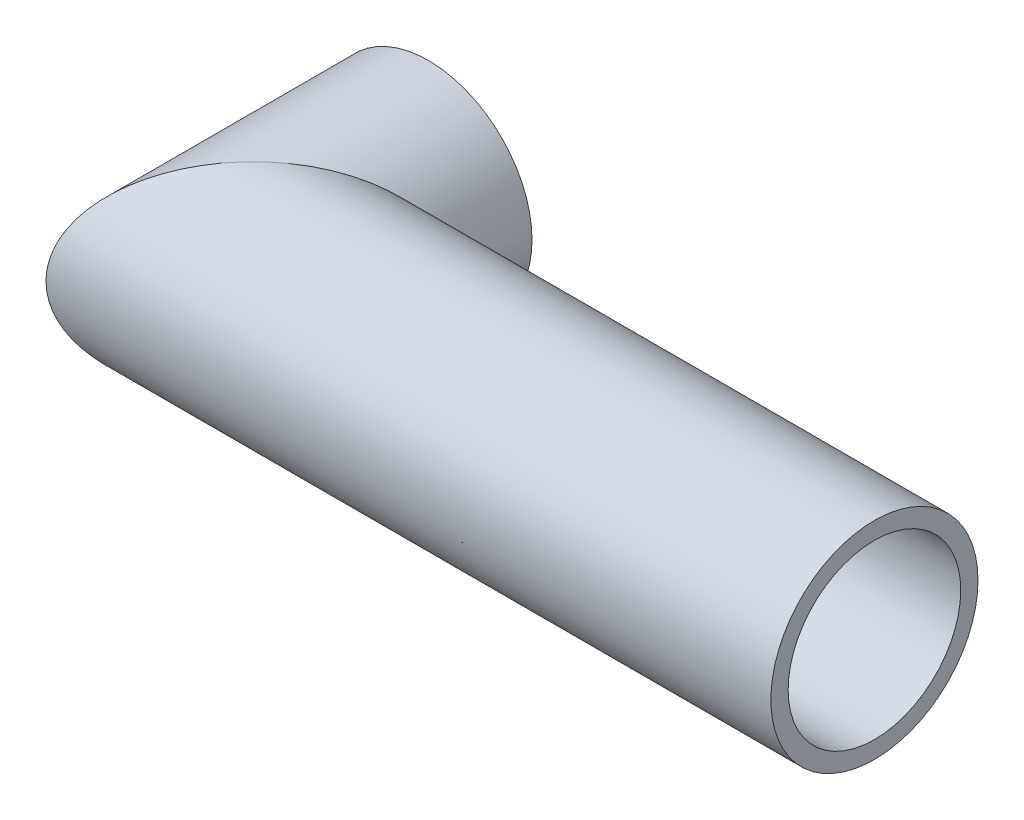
from build123d import *

# Parameters (mm, degrees)
CROQUIS1_R   = 6
CROQUIS1_R_2 = 5


with BuildPart() as part:
    # Barrer1: sweep along a path in Croquis2
    with BuildLine(Plane(origin=(0, 0, 0), x_dir=(1, 0, 0), z_dir=(0, 1, 0))) as barrer1_path:
        Line((0, 0), (0, -10.16))
        Line((0, -10.16), (36, -10.16))
    # Croquis1 → Barrer1 (sweep)
    with BuildSketch(Plane.XY):
        Circle(CROQUIS1_R)
        Circle(CROQUIS1_R_2, mode=Mode.SUBTRACT)
    sweep(path=barrer1_path.line, transition=Transition.RIGHT)


solid = part.part
